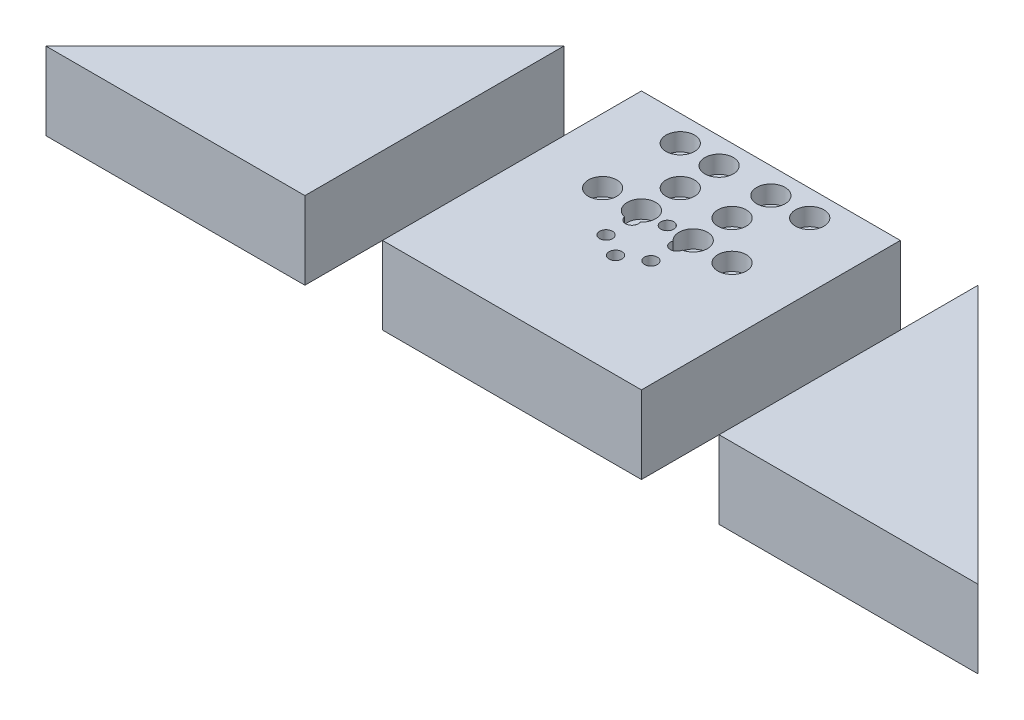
ISO-10303-21;
HEADER;
FILE_DESCRIPTION(('STEP AP214'),'2;1');
FILE_NAME('part.step','',(''),(''),'','','');
FILE_SCHEMA(('AUTOMOTIVE_DESIGN { 1 0 10303 214 1 1 1 1 }'));
ENDSEC;
DATA;
#1=APPLICATION_CONTEXT('core data for automotive mechanical design processes');
#2=APPLICATION_PROTOCOL_DEFINITION('international standard','automotive_design',2000,#1);
#3=PRODUCT_CONTEXT('',#1,'mechanical');
#4=PRODUCT('Part','Part','',(#3));
#5=PRODUCT_RELATED_PRODUCT_CATEGORY('part','',(#4));
#6=PRODUCT_DEFINITION_FORMATION('','',#4);
#7=PRODUCT_DEFINITION_CONTEXT('part definition',#1,'design');
#8=PRODUCT_DEFINITION('design','',#6,#7);
#9=PRODUCT_DEFINITION_SHAPE('','',#8);
#10=(LENGTH_UNIT() NAMED_UNIT(*) SI_UNIT(.MILLI.,.METRE.));
#11=(NAMED_UNIT(*) PLANE_ANGLE_UNIT() SI_UNIT($,.RADIAN.));
#12=(NAMED_UNIT(*) SI_UNIT($,.STERADIAN.) SOLID_ANGLE_UNIT());
#13=UNCERTAINTY_MEASURE_WITH_UNIT(LENGTH_MEASURE(1.E-05),#10,'distance_accuracy_value','');
#14=(GEOMETRIC_REPRESENTATION_CONTEXT(3) GLOBAL_UNCERTAINTY_ASSIGNED_CONTEXT((#13)) GLOBAL_UNIT_ASSIGNED_CONTEXT((#10,
#11,#12)) REPRESENTATION_CONTEXT('',''));
#15=CARTESIAN_POINT('',(0.,0.,0.));
#16=DIRECTION('',(0.,0.,1.));
#17=DIRECTION('',(1.,0.,0.));
#18=AXIS2_PLACEMENT_3D('',#15,#16,#17);
#19=CARTESIAN_POINT('',(-80.,30.,-50.));
#20=DIRECTION('',(-1.,0.,0.));
#21=DIRECTION('',(0.,0.,-1.));
#22=AXIS2_PLACEMENT_3D('',#19,#20,#21);
#23=PLANE('',#22);
#24=DIRECTION('',(0.,0.,1.));
#25=VECTOR('',#24,1.);
#26=CARTESIAN_POINT('',(-80.,0.,-50.));
#27=LINE('',#26,#25);
#28=CARTESIAN_POINT('',(-80.,0.,-50.));
#29=VERTEX_POINT('',#28);
#30=CARTESIAN_POINT('',(-80.,0.,50.));
#31=VERTEX_POINT('',#30);
#32=EDGE_CURVE('E98',#29,#31,#27,.T.);
#33=ORIENTED_EDGE('',*,*,#32,.F.);
#34=DIRECTION('',(0.,-1.,0.));
#35=VECTOR('',#34,1.);
#36=CARTESIAN_POINT('',(-80.,30.,-50.));
#37=LINE('',#36,#35);
#38=CARTESIAN_POINT('',(-80.,30.,-50.));
#39=VERTEX_POINT('',#38);
#40=EDGE_CURVE('E93',#39,#29,#37,.T.);
#41=ORIENTED_EDGE('',*,*,#40,.F.);
#42=DIRECTION('',(0.,0.,1.));
#43=VECTOR('',#42,1.);
#44=CARTESIAN_POINT('',(-80.,30.,-50.));
#45=LINE('',#44,#43);
#46=CARTESIAN_POINT('',(-80.,30.,50.));
#47=VERTEX_POINT('',#46);
#48=EDGE_CURVE('E85',#39,#47,#45,.T.);
#49=ORIENTED_EDGE('',*,*,#48,.T.);
#50=DIRECTION('',(0.,-1.,0.));
#51=VECTOR('',#50,1.);
#52=CARTESIAN_POINT('',(-80.,30.,50.));
#53=LINE('',#52,#51);
#54=EDGE_CURVE('E12',#47,#31,#53,.T.);
#55=ORIENTED_EDGE('',*,*,#54,.T.);
#56=EDGE_LOOP('',(#33,#41,#49,#55));
#57=FACE_BOUND('',#56,.T.);
#58=ADVANCED_FACE('F46',(#57),#23,.F.);
#59=CARTESIAN_POINT('',(-80.,30.,50.));
#60=DIRECTION('',(0.,0.,-1.));
#61=DIRECTION('',(1.,0.,0.));
#62=AXIS2_PLACEMENT_3D('',#59,#60,#61);
#63=PLANE('',#62);
#64=DIRECTION('',(-1.,0.,0.));
#65=VECTOR('',#64,1.);
#66=CARTESIAN_POINT('',(-80.,0.,50.));
#67=LINE('',#66,#65);
#68=CARTESIAN_POINT('',(-180.,0.,50.));
#69=VERTEX_POINT('',#68);
#70=EDGE_CURVE('E90',#31,#69,#67,.T.);
#71=ORIENTED_EDGE('',*,*,#70,.F.);
#72=ORIENTED_EDGE('',*,*,#54,.F.);
#73=DIRECTION('',(-1.,0.,0.));
#74=VECTOR('',#73,1.);
#75=CARTESIAN_POINT('',(-80.,30.,50.));
#76=LINE('',#75,#74);
#77=CARTESIAN_POINT('',(-180.,30.,50.));
#78=VERTEX_POINT('',#77);
#79=EDGE_CURVE('E81',#47,#78,#76,.T.);
#80=ORIENTED_EDGE('',*,*,#79,.T.);
#81=DIRECTION('',(0.,-1.,0.));
#82=VECTOR('',#81,1.);
#83=CARTESIAN_POINT('',(-180.,30.,50.));
#84=LINE('',#83,#82);
#85=EDGE_CURVE('E54',#78,#69,#84,.T.);
#86=ORIENTED_EDGE('',*,*,#85,.T.);
#87=EDGE_LOOP('',(#71,#72,#80,#86));
#88=FACE_BOUND('',#87,.T.);
#89=ADVANCED_FACE('F89',(#88),#63,.F.);
#90=CARTESIAN_POINT('',(-180.,30.,50.));
#91=DIRECTION('',(0.707106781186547,0.,0.707106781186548));
#92=DIRECTION('',(-0.707106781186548,0.,0.707106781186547));
#93=AXIS2_PLACEMENT_3D('',#90,#91,#92);
#94=PLANE('',#93);
#95=DIRECTION('',(0.707106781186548,0.,-0.707106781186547));
#96=VECTOR('',#95,1.);
#97=CARTESIAN_POINT('',(-180.,0.,50.));
#98=LINE('',#97,#96);
#99=EDGE_CURVE('E73',#69,#29,#98,.T.);
#100=ORIENTED_EDGE('',*,*,#99,.F.);
#101=ORIENTED_EDGE('',*,*,#85,.F.);
#102=DIRECTION('',(0.707106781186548,0.,-0.707106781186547));
#103=VECTOR('',#102,1.);
#104=CARTESIAN_POINT('',(-180.,30.,50.));
#105=LINE('',#104,#103);
#106=EDGE_CURVE('E62',#78,#39,#105,.T.);
#107=ORIENTED_EDGE('',*,*,#106,.T.);
#108=ORIENTED_EDGE('',*,*,#40,.T.);
#109=EDGE_LOOP('',(#100,#101,#107,#108));
#110=FACE_BOUND('',#109,.T.);
#111=ADVANCED_FACE('F107',(#110),#94,.F.);
#112=CARTESIAN_POINT('',(0.,30.,0.));
#113=DIRECTION('',(0.,1.,0.));
#114=DIRECTION('',(0.,0.,1.));
#115=AXIS2_PLACEMENT_3D('',#112,#113,#114);
#116=PLANE('',#115);
#117=ORIENTED_EDGE('',*,*,#48,.F.);
#118=ORIENTED_EDGE('',*,*,#106,.F.);
#119=ORIENTED_EDGE('',*,*,#79,.F.);
#120=EDGE_LOOP('',(#117,#118,#119));
#121=FACE_BOUND('',#120,.T.);
#122=ADVANCED_FACE('F83',(#121),#116,.T.);
#123=CARTESIAN_POINT('',(0.,0.,0.));
#124=DIRECTION('',(0.,1.,0.));
#125=DIRECTION('',(0.,0.,1.));
#126=AXIS2_PLACEMENT_3D('',#123,#124,#125);
#127=PLANE('',#126);
#128=ORIENTED_EDGE('',*,*,#32,.T.);
#129=ORIENTED_EDGE('',*,*,#70,.T.);
#130=ORIENTED_EDGE('',*,*,#99,.T.);
#131=EDGE_LOOP('',(#128,#129,#130));
#132=FACE_BOUND('',#131,.T.);
#133=ADVANCED_FACE('F101',(#132),#127,.F.);
#134=CLOSED_SHELL('',(#58,#89,#111,#122,#133));
#135=MANIFOLD_SOLID_BREP('B2',#134);
#136=CARTESIAN_POINT('',(80.,30.,-50.));
#137=DIRECTION('',(1.,0.,0.));
#138=DIRECTION('',(0.,0.,-1.));
#139=AXIS2_PLACEMENT_3D('',#136,#137,#138);
#140=PLANE('',#139);
#141=DIRECTION('',(0.,0.,1.));
#142=VECTOR('',#141,1.);
#143=CARTESIAN_POINT('',(80.,0.,-50.));
#144=LINE('',#143,#142);
#145=CARTESIAN_POINT('',(80.,0.,-50.));
#146=VERTEX_POINT('',#145);
#147=CARTESIAN_POINT('',(80.,0.,50.));
#148=VERTEX_POINT('',#147);
#149=EDGE_CURVE('E200',#146,#148,#144,.T.);
#150=ORIENTED_EDGE('',*,*,#149,.T.);
#151=DIRECTION('',(0.,-1.,0.));
#152=VECTOR('',#151,1.);
#153=CARTESIAN_POINT('',(80.,30.,50.));
#154=LINE('',#153,#152);
#155=CARTESIAN_POINT('',(80.,30.,50.));
#156=VERTEX_POINT('',#155);
#157=EDGE_CURVE('E44',#156,#148,#154,.T.);
#158=ORIENTED_EDGE('',*,*,#157,.F.);
#159=DIRECTION('',(0.,0.,1.));
#160=VECTOR('',#159,1.);
#161=CARTESIAN_POINT('',(80.,30.,-50.));
#162=LINE('',#161,#160);
#163=CARTESIAN_POINT('',(80.,30.,-50.));
#164=VERTEX_POINT('',#163);
#165=EDGE_CURVE('E193',#164,#156,#162,.T.);
#166=ORIENTED_EDGE('',*,*,#165,.F.);
#167=DIRECTION('',(0.,-1.,0.));
#168=VECTOR('',#167,1.);
#169=CARTESIAN_POINT('',(80.,30.,-50.));
#170=LINE('',#169,#168);
#171=EDGE_CURVE('E201',#164,#146,#170,.T.);
#172=ORIENTED_EDGE('',*,*,#171,.T.);
#173=EDGE_LOOP('',(#150,#158,#166,#172));
#174=FACE_BOUND('',#173,.T.);
#175=ADVANCED_FACE('F153',(#174),#140,.F.);
#176=CARTESIAN_POINT('',(80.,30.,50.));
#177=DIRECTION('',(0.,0.,-1.));
#178=DIRECTION('',(-1.,0.,0.));
#179=AXIS2_PLACEMENT_3D('',#176,#177,#178);
#180=PLANE('',#179);
#181=DIRECTION('',(1.,0.,0.));
#182=VECTOR('',#181,1.);
#183=CARTESIAN_POINT('',(80.,0.,50.));
#184=LINE('',#183,#182);
#185=CARTESIAN_POINT('',(180.,0.,50.));
#186=VERTEX_POINT('',#185);
#187=EDGE_CURVE('E181',#148,#186,#184,.T.);
#188=ORIENTED_EDGE('',*,*,#187,.T.);
#189=DIRECTION('',(0.,-1.,0.));
#190=VECTOR('',#189,1.);
#191=CARTESIAN_POINT('',(180.,30.,50.));
#192=LINE('',#191,#190);
#193=CARTESIAN_POINT('',(180.,30.,50.));
#194=VERTEX_POINT('',#193);
#195=EDGE_CURVE('E161',#194,#186,#192,.T.);
#196=ORIENTED_EDGE('',*,*,#195,.F.);
#197=DIRECTION('',(1.,0.,0.));
#198=VECTOR('',#197,1.);
#199=CARTESIAN_POINT('',(80.,30.,50.));
#200=LINE('',#199,#198);
#201=EDGE_CURVE('E189',#156,#194,#200,.T.);
#202=ORIENTED_EDGE('',*,*,#201,.F.);
#203=ORIENTED_EDGE('',*,*,#157,.T.);
#204=EDGE_LOOP('',(#188,#196,#202,#203));
#205=FACE_BOUND('',#204,.T.);
#206=ADVANCED_FACE('F190',(#205),#180,.F.);
#207=CARTESIAN_POINT('',(180.,30.,50.));
#208=DIRECTION('',(-0.707106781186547,0.,0.707106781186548));
#209=DIRECTION('',(0.707106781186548,0.,0.707106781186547));
#210=AXIS2_PLACEMENT_3D('',#207,#208,#209);
#211=PLANE('',#210);
#212=DIRECTION('',(-0.707106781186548,0.,-0.707106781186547));
#213=VECTOR('',#212,1.);
#214=CARTESIAN_POINT('',(180.,0.,50.));
#215=LINE('',#214,#213);
#216=EDGE_CURVE('E186',#186,#146,#215,.T.);
#217=ORIENTED_EDGE('',*,*,#216,.T.);
#218=ORIENTED_EDGE('',*,*,#171,.F.);
#219=DIRECTION('',(-0.707106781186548,0.,-0.707106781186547));
#220=VECTOR('',#219,1.);
#221=CARTESIAN_POINT('',(180.,30.,50.));
#222=LINE('',#221,#220);
#223=EDGE_CURVE('E169',#194,#164,#222,.T.);
#224=ORIENTED_EDGE('',*,*,#223,.F.);
#225=ORIENTED_EDGE('',*,*,#195,.T.);
#226=EDGE_LOOP('',(#217,#218,#224,#225));
#227=FACE_BOUND('',#226,.T.);
#228=ADVANCED_FACE('F208',(#227),#211,.F.);
#229=CARTESIAN_POINT('',(0.,30.,0.));
#230=DIRECTION('',(0.,1.,0.));
#231=DIRECTION('',(0.,0.,1.));
#232=AXIS2_PLACEMENT_3D('',#229,#230,#231);
#233=PLANE('',#232);
#234=ORIENTED_EDGE('',*,*,#165,.T.);
#235=ORIENTED_EDGE('',*,*,#201,.T.);
#236=ORIENTED_EDGE('',*,*,#223,.T.);
#237=EDGE_LOOP('',(#234,#235,#236));
#238=FACE_BOUND('',#237,.T.);
#239=ADVANCED_FACE('F196',(#238),#233,.T.);
#240=CARTESIAN_POINT('',(0.,0.,0.));
#241=DIRECTION('',(0.,1.,0.));
#242=DIRECTION('',(0.,0.,1.));
#243=AXIS2_PLACEMENT_3D('',#240,#241,#242);
#244=PLANE('',#243);
#245=ORIENTED_EDGE('',*,*,#149,.F.);
#246=ORIENTED_EDGE('',*,*,#216,.F.);
#247=ORIENTED_EDGE('',*,*,#187,.F.);
#248=EDGE_LOOP('',(#245,#246,#247));
#249=FACE_BOUND('',#248,.T.);
#250=ADVANCED_FACE('F209',(#249),#244,.F.);
#251=CLOSED_SHELL('',(#175,#206,#228,#239,#250));
#252=MANIFOLD_SOLID_BREP('B6',#251);
#253=CARTESIAN_POINT('',(0.,0.,0.));
#254=DIRECTION('',(0.,-1.,0.));
#255=DIRECTION('',(0.,0.,-1.));
#256=AXIS2_PLACEMENT_3D('',#253,#254,#255);
#257=PLANE('',#256);
#258=CARTESIAN_POINT('',(8.66025403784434,0.,-5.0000000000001));
#259=DIRECTION('',(0.,1.,0.));
#260=DIRECTION('',(0.,0.,1.));
#261=AXIS2_PLACEMENT_3D('',#258,#259,#260);
#262=CIRCLE('',#261,2.5);
#263=CARTESIAN_POINT('',(7.96572766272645,0.,-7.40158970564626));
#264=VERTEX_POINT('',#263);
#265=CARTESIAN_POINT('',(10.4625263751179,0.,-6.73257450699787));
#266=VERTEX_POINT('',#265);
#267=EDGE_CURVE('E347',#264,#266,#262,.T.);
#268=ORIENTED_EDGE('',*,*,#267,.T.);
#269=CARTESIAN_POINT('',(10.,0.,-10.));
#270=DIRECTION('',(0.,1.,0.));
#271=DIRECTION('',(0.,0.,1.));
#272=AXIS2_PLACEMENT_3D('',#269,#270,#271);
#273=CIRCLE('',#272,3.29999999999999);
#274=EDGE_CURVE('E266',#266,#264,#273,.T.);
#275=ORIENTED_EDGE('',*,*,#274,.T.);
#276=EDGE_LOOP('',(#268,#275));
#277=FACE_BOUND('',#276,.T.);
#278=CARTESIAN_POINT('',(0.,0.,10.));
#279=DIRECTION('',(0.,1.,0.));
#280=DIRECTION('',(0.,0.,1.));
#281=AXIS2_PLACEMENT_3D('',#278,#279,#280);
#282=CIRCLE('',#281,2.49999999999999);
#283=CARTESIAN_POINT('',(0.,0.,12.5));
#284=VERTEX_POINT('',#283);
#285=EDGE_CURVE('E369',#284,#284,#282,.T.);
#286=ORIENTED_EDGE('',*,*,#285,.T.);
#287=EDGE_LOOP('',(#286));
#288=FACE_BOUND('',#287,.T.);
#289=CARTESIAN_POINT('',(-8.66025403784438,0.,5.00000000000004));
#290=DIRECTION('',(0.,1.,0.));
#291=DIRECTION('',(0.,0.,1.));
#292=AXIS2_PLACEMENT_3D('',#289,#290,#291);
#293=CIRCLE('',#292,2.5);
#294=CARTESIAN_POINT('',(-8.66025403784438,0.,7.50000000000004));
#295=VERTEX_POINT('',#294);
#296=EDGE_CURVE('E375',#295,#295,#293,.T.);
#297=ORIENTED_EDGE('',*,*,#296,.T.);
#298=EDGE_LOOP('',(#297));
#299=FACE_BOUND('',#298,.T.);
#300=CARTESIAN_POINT('',(-10.,0.,-40.));
#301=DIRECTION('',(0.,1.,0.));
#302=DIRECTION('',(0.,0.,1.));
#303=AXIS2_PLACEMENT_3D('',#300,#301,#302);
#304=CIRCLE('',#303,3.29999999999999);
#305=CARTESIAN_POINT('',(-10.,0.,-36.7));
#306=VERTEX_POINT('',#305);
#307=EDGE_CURVE('E400',#306,#306,#304,.T.);
#308=ORIENTED_EDGE('',*,*,#307,.T.);
#309=EDGE_LOOP('',(#308));
#310=FACE_BOUND('',#309,.T.);
#311=CARTESIAN_POINT('',(-10.,0.,-25.));
#312=DIRECTION('',(0.,1.,0.));
#313=DIRECTION('',(0.,0.,1.));
#314=AXIS2_PLACEMENT_3D('',#311,#312,#313);
#315=CIRCLE('',#314,3.29999999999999);
#316=CARTESIAN_POINT('',(-10.,0.,-21.7));
#317=VERTEX_POINT('',#316);
#318=EDGE_CURVE('E412',#317,#317,#315,.T.);
#319=ORIENTED_EDGE('',*,*,#318,.T.);
#320=EDGE_LOOP('',(#319));
#321=FACE_BOUND('',#320,.T.);
#322=CARTESIAN_POINT('',(-25.,0.,-40.));
#323=DIRECTION('',(0.,1.,0.));
#324=DIRECTION('',(0.,0.,1.));
#325=AXIS2_PLACEMENT_3D('',#322,#323,#324);
#326=CIRCLE('',#325,3.29999999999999);
#327=CARTESIAN_POINT('',(-25.,0.,-36.7));
#328=VERTEX_POINT('',#327);
#329=EDGE_CURVE('E436',#328,#328,#326,.T.);
#330=ORIENTED_EDGE('',*,*,#329,.T.);
#331=EDGE_LOOP('',(#330));
#332=FACE_BOUND('',#331,.T.);
#333=CARTESIAN_POINT('',(0.,0.,-10.));
#334=DIRECTION('',(0.,1.,0.));
#335=DIRECTION('',(0.,0.,1.));
#336=AXIS2_PLACEMENT_3D('',#333,#334,#335);
#337=CIRCLE('',#336,2.49999999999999);
#338=CARTESIAN_POINT('',(0.,0.,-7.50000000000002));
#339=VERTEX_POINT('',#338);
#340=EDGE_CURVE('E442',#339,#339,#337,.T.);
#341=ORIENTED_EDGE('',*,*,#340,.T.);
#342=EDGE_LOOP('',(#341));
#343=FACE_BOUND('',#342,.T.);
#344=CARTESIAN_POINT('',(-25.,0.,-10.));
#345=DIRECTION('',(0.,1.,0.));
#346=DIRECTION('',(0.,0.,1.));
#347=AXIS2_PLACEMENT_3D('',#344,#345,#346);
#348=CIRCLE('',#347,3.29999999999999);
#349=CARTESIAN_POINT('',(-25.,0.,-6.70000000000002));
#350=VERTEX_POINT('',#349);
#351=EDGE_CURVE('E454',#350,#350,#348,.T.);
#352=ORIENTED_EDGE('',*,*,#351,.T.);
#353=EDGE_LOOP('',(#352));
#354=FACE_BOUND('',#353,.T.);
#355=DIRECTION('',(0.,0.,-1.));
#356=VECTOR('',#355,1.);
#357=CARTESIAN_POINT('',(50.,0.,50.));
#358=LINE('',#357,#356);
#359=CARTESIAN_POINT('',(50.,0.,50.));
#360=VERTEX_POINT('',#359);
#361=CARTESIAN_POINT('',(50.,0.,-50.));
#362=VERTEX_POINT('',#361);
#363=EDGE_CURVE('E457',#360,#362,#358,.T.);
#364=ORIENTED_EDGE('',*,*,#363,.F.);
#365=DIRECTION('',(1.,0.,0.));
#366=VECTOR('',#365,1.);
#367=CARTESIAN_POINT('',(-50.,0.,50.));
#368=LINE('',#367,#366);
#369=CARTESIAN_POINT('',(-50.,0.,50.));
#370=VERTEX_POINT('',#369);
#371=EDGE_CURVE('E462',#370,#360,#368,.T.);
#372=ORIENTED_EDGE('',*,*,#371,.F.);
#373=DIRECTION('',(0.,0.,1.));
#374=VECTOR('',#373,1.);
#375=CARTESIAN_POINT('',(-50.,0.,50.));
#376=LINE('',#375,#374);
#377=CARTESIAN_POINT('',(-50.,0.,-50.));
#378=VERTEX_POINT('',#377);
#379=EDGE_CURVE('E473',#378,#370,#376,.T.);
#380=ORIENTED_EDGE('',*,*,#379,.F.);
#381=DIRECTION('',(-1.,0.,0.));
#382=VECTOR('',#381,1.);
#383=CARTESIAN_POINT('',(-50.,0.,-50.));
#384=LINE('',#383,#382);
#385=EDGE_CURVE('E471',#362,#378,#384,.T.);
#386=ORIENTED_EDGE('',*,*,#385,.F.);
#387=EDGE_LOOP('',(#364,#372,#380,#386));
#388=FACE_BOUND('',#387,.T.);
#389=CARTESIAN_POINT('',(-10.,0.,-10.));
#390=DIRECTION('',(0.,1.,0.));
#391=DIRECTION('',(0.,0.,1.));
#392=AXIS2_PLACEMENT_3D('',#389,#390,#391);
#393=CIRCLE('',#392,3.29999999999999);
#394=CARTESIAN_POINT('',(-7.96572766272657,0.,-7.40158970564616));
#395=VERTEX_POINT('',#394);
#396=CARTESIAN_POINT('',(-10.4625263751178,0.,-6.73257450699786));
#397=VERTEX_POINT('',#396);
#398=EDGE_CURVE('E424',#395,#397,#393,.T.);
#399=ORIENTED_EDGE('',*,*,#398,.T.);
#400=CARTESIAN_POINT('',(-8.66025403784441,0.,-4.99999999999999));
#401=DIRECTION('',(0.,1.,0.));
#402=DIRECTION('',(0.,0.,1.));
#403=AXIS2_PLACEMENT_3D('',#400,#401,#402);
#404=CIRCLE('',#403,2.5);
#405=EDGE_CURVE('E380',#397,#395,#404,.T.);
#406=ORIENTED_EDGE('',*,*,#405,.T.);
#407=EDGE_LOOP('',(#399,#406));
#408=FACE_BOUND('',#407,.T.);
#409=CARTESIAN_POINT('',(8.66025403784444,0.,4.99999999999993));
#410=DIRECTION('',(0.,1.,0.));
#411=DIRECTION('',(0.,0.,1.));
#412=AXIS2_PLACEMENT_3D('',#409,#410,#411);
#413=CIRCLE('',#412,2.5);
#414=CARTESIAN_POINT('',(8.66025403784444,0.,7.49999999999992));
#415=VERTEX_POINT('',#414);
#416=EDGE_CURVE('E357',#415,#415,#413,.T.);
#417=ORIENTED_EDGE('',*,*,#416,.T.);
#418=EDGE_LOOP('',(#417));
#419=FACE_BOUND('',#418,.T.);
#420=CARTESIAN_POINT('',(25.,0.,-10.));
#421=DIRECTION('',(0.,1.,0.));
#422=DIRECTION('',(0.,0.,1.));
#423=AXIS2_PLACEMENT_3D('',#420,#421,#422);
#424=CIRCLE('',#423,3.29999999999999);
#425=CARTESIAN_POINT('',(25.,0.,-6.70000000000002));
#426=VERTEX_POINT('',#425);
#427=EDGE_CURVE('E360',#426,#426,#424,.T.);
#428=ORIENTED_EDGE('',*,*,#427,.T.);
#429=EDGE_LOOP('',(#428));
#430=FACE_BOUND('',#429,.T.);
#431=CARTESIAN_POINT('',(25.,0.,-40.));
#432=DIRECTION('',(0.,1.,0.));
#433=DIRECTION('',(0.,0.,1.));
#434=AXIS2_PLACEMENT_3D('',#431,#432,#433);
#435=CIRCLE('',#434,3.29999999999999);
#436=CARTESIAN_POINT('',(25.,0.,-36.7));
#437=VERTEX_POINT('',#436);
#438=EDGE_CURVE('E521',#437,#437,#435,.T.);
#439=ORIENTED_EDGE('',*,*,#438,.T.);
#440=EDGE_LOOP('',(#439));
#441=FACE_BOUND('',#440,.T.);
#442=CARTESIAN_POINT('',(10.,0.,-25.));
#443=DIRECTION('',(0.,1.,0.));
#444=DIRECTION('',(0.,0.,1.));
#445=AXIS2_PLACEMENT_3D('',#442,#443,#444);
#446=CIRCLE('',#445,3.29999999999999);
#447=CARTESIAN_POINT('',(10.,0.,-21.7));
#448=VERTEX_POINT('',#447);
#449=EDGE_CURVE('E509',#448,#448,#446,.T.);
#450=ORIENTED_EDGE('',*,*,#449,.T.);
#451=EDGE_LOOP('',(#450));
#452=FACE_BOUND('',#451,.T.);
#453=CARTESIAN_POINT('',(10.,0.,-40.));
#454=DIRECTION('',(0.,1.,0.));
#455=DIRECTION('',(0.,0.,1.));
#456=AXIS2_PLACEMENT_3D('',#453,#454,#455);
#457=CIRCLE('',#456,3.29999999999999);
#458=CARTESIAN_POINT('',(10.,0.,-36.7));
#459=VERTEX_POINT('',#458);
#460=EDGE_CURVE('E570',#459,#459,#457,.T.);
#461=ORIENTED_EDGE('',*,*,#460,.T.);
#462=EDGE_LOOP('',(#461));
#463=FACE_BOUND('',#462,.T.);
#464=ADVANCED_FACE('F251',(#277,#288,#299,#310,#321,#332,#343,#354,#388,#408,#419,#430,#441,
#452,#463),#257,.T.);
#465=CARTESIAN_POINT('',(0.,30.,0.));
#466=DIRECTION('',(0.,-1.,0.));
#467=DIRECTION('',(0.,0.,-1.));
#468=AXIS2_PLACEMENT_3D('',#465,#466,#467);
#469=PLANE('',#468);
#470=CARTESIAN_POINT('',(10.,30.,-40.));
#471=DIRECTION('',(0.,1.,0.));
#472=DIRECTION('',(0.,0.,1.));
#473=AXIS2_PLACEMENT_3D('',#470,#471,#472);
#474=CIRCLE('',#473,5.49999999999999);
#475=CARTESIAN_POINT('',(10.,30.,-34.5));
#476=VERTEX_POINT('',#475);
#477=EDGE_CURVE('E955',#476,#476,#474,.T.);
#478=ORIENTED_EDGE('',*,*,#477,.F.);
#479=EDGE_LOOP('',(#478));
#480=FACE_BOUND('',#479,.T.);
#481=CARTESIAN_POINT('',(0.,30.,10.));
#482=DIRECTION('',(0.,1.,0.));
#483=DIRECTION('',(0.,0.,1.));
#484=AXIS2_PLACEMENT_3D('',#481,#482,#483);
#485=CIRCLE('',#484,2.49999999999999);
#486=CARTESIAN_POINT('',(0.,30.,12.5));
#487=VERTEX_POINT('',#486);
#488=EDGE_CURVE('E366',#487,#487,#485,.T.);
#489=ORIENTED_EDGE('',*,*,#488,.F.);
#490=EDGE_LOOP('',(#489));
#491=FACE_BOUND('',#490,.T.);
#492=CARTESIAN_POINT('',(-8.66025403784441,30.,-4.99999999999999));
#493=DIRECTION('',(0.,1.,0.));
#494=DIRECTION('',(0.,0.,1.));
#495=AXIS2_PLACEMENT_3D('',#492,#493,#494);
#496=CIRCLE('',#495,2.49999999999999);
#497=CARTESIAN_POINT('',(-11.1308203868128,30.,-4.61750566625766));
#498=VERTEX_POINT('',#497);
#499=CARTESIAN_POINT('',(-6.32943365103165,30.,-5.90403336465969));
#500=VERTEX_POINT('',#499);
#501=EDGE_CURVE('E378',#498,#500,#496,.T.);
#502=ORIENTED_EDGE('',*,*,#501,.F.);
#503=CARTESIAN_POINT('',(-10.,30.,-10.));
#504=DIRECTION('',(0.,1.,0.));
#505=DIRECTION('',(0.,0.,1.));
#506=AXIS2_PLACEMENT_3D('',#503,#504,#505);
#507=CIRCLE('',#506,5.49999999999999);
#508=EDGE_CURVE('E415',#500,#498,#507,.T.);
#509=ORIENTED_EDGE('',*,*,#508,.F.);
#510=EDGE_LOOP('',(#502,#509));
#511=FACE_BOUND('',#510,.T.);
#512=CARTESIAN_POINT('',(-10.,30.,-25.));
#513=DIRECTION('',(0.,1.,0.));
#514=DIRECTION('',(0.,0.,1.));
#515=AXIS2_PLACEMENT_3D('',#512,#513,#514);
#516=CIRCLE('',#515,5.49999999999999);
#517=CARTESIAN_POINT('',(-10.,30.,-19.5));
#518=VERTEX_POINT('',#517);
#519=EDGE_CURVE('E403',#518,#518,#516,.T.);
#520=ORIENTED_EDGE('',*,*,#519,.F.);
#521=EDGE_LOOP('',(#520));
#522=FACE_BOUND('',#521,.T.);
#523=CARTESIAN_POINT('',(-25.,30.,-40.));
#524=DIRECTION('',(0.,1.,0.));
#525=DIRECTION('',(0.,0.,1.));
#526=AXIS2_PLACEMENT_3D('',#523,#524,#525);
#527=CIRCLE('',#526,5.49999999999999);
#528=CARTESIAN_POINT('',(-25.,30.,-34.5));
#529=VERTEX_POINT('',#528);
#530=EDGE_CURVE('E427',#529,#529,#527,.T.);
#531=ORIENTED_EDGE('',*,*,#530,.F.);
#532=EDGE_LOOP('',(#531));
#533=FACE_BOUND('',#532,.T.);
#534=CARTESIAN_POINT('',(0.,30.,-10.));
#535=DIRECTION('',(0.,1.,0.));
#536=DIRECTION('',(0.,0.,1.));
#537=AXIS2_PLACEMENT_3D('',#534,#535,#536);
#538=CIRCLE('',#537,2.49999999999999);
#539=CARTESIAN_POINT('',(0.,30.,-7.50000000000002));
#540=VERTEX_POINT('',#539);
#541=EDGE_CURVE('E439',#540,#540,#538,.T.);
#542=ORIENTED_EDGE('',*,*,#541,.F.);
#543=EDGE_LOOP('',(#542));
#544=FACE_BOUND('',#543,.T.);
#545=CARTESIAN_POINT('',(-25.,30.,-10.));
#546=DIRECTION('',(0.,1.,0.));
#547=DIRECTION('',(0.,0.,1.));
#548=AXIS2_PLACEMENT_3D('',#545,#546,#547);
#549=CIRCLE('',#548,5.49999999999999);
#550=CARTESIAN_POINT('',(-25.,30.,-4.50000000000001));
#551=VERTEX_POINT('',#550);
#552=EDGE_CURVE('E445',#551,#551,#549,.T.);
#553=ORIENTED_EDGE('',*,*,#552,.F.);
#554=EDGE_LOOP('',(#553));
#555=FACE_BOUND('',#554,.T.);
#556=DIRECTION('',(0.,0.,-1.));
#557=VECTOR('',#556,1.);
#558=CARTESIAN_POINT('',(50.,30.,50.));
#559=LINE('',#558,#557);
#560=CARTESIAN_POINT('',(50.,30.,50.));
#561=VERTEX_POINT('',#560);
#562=CARTESIAN_POINT('',(50.,30.,-50.));
#563=VERTEX_POINT('',#562);
#564=EDGE_CURVE('E458',#561,#563,#559,.T.);
#565=ORIENTED_EDGE('',*,*,#564,.T.);
#566=DIRECTION('',(-1.,0.,0.));
#567=VECTOR('',#566,1.);
#568=CARTESIAN_POINT('',(-50.,30.,-50.));
#569=LINE('',#568,#567);
#570=CARTESIAN_POINT('',(-50.,30.,-50.));
#571=VERTEX_POINT('',#570);
#572=EDGE_CURVE('E461',#563,#571,#569,.T.);
#573=ORIENTED_EDGE('',*,*,#572,.T.);
#574=DIRECTION('',(0.,0.,1.));
#575=VECTOR('',#574,1.);
#576=CARTESIAN_POINT('',(-50.,30.,50.));
#577=LINE('',#576,#575);
#578=CARTESIAN_POINT('',(-50.,30.,50.));
#579=VERTEX_POINT('',#578);
#580=EDGE_CURVE('E464',#571,#579,#577,.T.);
#581=ORIENTED_EDGE('',*,*,#580,.T.);
#582=DIRECTION('',(1.,0.,0.));
#583=VECTOR('',#582,1.);
#584=CARTESIAN_POINT('',(-50.,30.,50.));
#585=LINE('',#584,#583);
#586=EDGE_CURVE('E466',#579,#561,#585,.T.);
#587=ORIENTED_EDGE('',*,*,#586,.T.);
#588=EDGE_LOOP('',(#565,#573,#581,#587));
#589=FACE_BOUND('',#588,.T.);
#590=CARTESIAN_POINT('',(-10.,30.,-40.));
#591=DIRECTION('',(0.,1.,0.));
#592=DIRECTION('',(0.,0.,1.));
#593=AXIS2_PLACEMENT_3D('',#590,#591,#592);
#594=CIRCLE('',#593,5.49999999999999);
#595=CARTESIAN_POINT('',(-10.,30.,-34.5));
#596=VERTEX_POINT('',#595);
#597=EDGE_CURVE('E391',#596,#596,#594,.T.);
#598=ORIENTED_EDGE('',*,*,#597,.F.);
#599=EDGE_LOOP('',(#598));
#600=FACE_BOUND('',#599,.T.);
#601=CARTESIAN_POINT('',(-8.66025403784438,30.,5.00000000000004));
#602=DIRECTION('',(0.,1.,0.));
#603=DIRECTION('',(0.,0.,1.));
#604=AXIS2_PLACEMENT_3D('',#601,#602,#603);
#605=CIRCLE('',#604,2.49999999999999);
#606=CARTESIAN_POINT('',(-8.66025403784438,30.,7.50000000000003));
#607=VERTEX_POINT('',#606);
#608=EDGE_CURVE('E372',#607,#607,#605,.T.);
#609=ORIENTED_EDGE('',*,*,#608,.F.);
#610=EDGE_LOOP('',(#609));
#611=FACE_BOUND('',#610,.T.);
#612=CARTESIAN_POINT('',(8.66025403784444,30.,4.99999999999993));
#613=DIRECTION('',(0.,1.,0.));
#614=DIRECTION('',(0.,0.,1.));
#615=AXIS2_PLACEMENT_3D('',#612,#613,#614);
#616=CIRCLE('',#615,2.49999999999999);
#617=CARTESIAN_POINT('',(8.66025403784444,30.,7.49999999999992));
#618=VERTEX_POINT('',#617);
#619=EDGE_CURVE('E353',#618,#618,#616,.T.);
#620=ORIENTED_EDGE('',*,*,#619,.F.);
#621=EDGE_LOOP('',(#620));
#622=FACE_BOUND('',#621,.T.);
#623=CARTESIAN_POINT('',(25.,30.,-10.));
#624=DIRECTION('',(0.,1.,0.));
#625=DIRECTION('',(0.,0.,1.));
#626=AXIS2_PLACEMENT_3D('',#623,#624,#625);
#627=CIRCLE('',#626,5.49999999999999);
#628=CARTESIAN_POINT('',(25.,30.,-4.50000000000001));
#629=VERTEX_POINT('',#628);
#630=EDGE_CURVE('E524',#629,#629,#627,.T.);
#631=ORIENTED_EDGE('',*,*,#630,.F.);
#632=EDGE_LOOP('',(#631));
#633=FACE_BOUND('',#632,.T.);
#634=CARTESIAN_POINT('',(25.,30.,-40.));
#635=DIRECTION('',(0.,1.,0.));
#636=DIRECTION('',(0.,0.,1.));
#637=AXIS2_PLACEMENT_3D('',#634,#635,#636);
#638=CIRCLE('',#637,5.49999999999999);
#639=CARTESIAN_POINT('',(25.,30.,-34.5));
#640=VERTEX_POINT('',#639);
#641=EDGE_CURVE('E348',#640,#640,#638,.T.);
#642=ORIENTED_EDGE('',*,*,#641,.F.);
#643=EDGE_LOOP('',(#642));
#644=FACE_BOUND('',#643,.T.);
#645=CARTESIAN_POINT('',(10.,30.,-10.));
#646=DIRECTION('',(0.,1.,0.));
#647=DIRECTION('',(0.,0.,1.));
#648=AXIS2_PLACEMENT_3D('',#645,#646,#647);
#649=CIRCLE('',#648,5.49999999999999);
#650=CARTESIAN_POINT('',(11.1308203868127,30.,-4.61750566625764));
#651=VERTEX_POINT('',#650);
#652=CARTESIAN_POINT('',(6.32943365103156,30.,-5.90403336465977));
#653=VERTEX_POINT('',#652);
#654=EDGE_CURVE('E506',#651,#653,#649,.T.);
#655=ORIENTED_EDGE('',*,*,#654,.F.);
#656=CARTESIAN_POINT('',(8.66025403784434,30.,-5.0000000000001));
#657=DIRECTION('',(0.,1.,0.));
#658=DIRECTION('',(0.,0.,1.));
#659=AXIS2_PLACEMENT_3D('',#656,#657,#658);
#660=CIRCLE('',#659,2.49999999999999);
#661=EDGE_CURVE('E354',#653,#651,#660,.T.);
#662=ORIENTED_EDGE('',*,*,#661,.F.);
#663=EDGE_LOOP('',(#655,#662));
#664=FACE_BOUND('',#663,.T.);
#665=CARTESIAN_POINT('',(10.,30.,-25.));
#666=DIRECTION('',(0.,1.,0.));
#667=DIRECTION('',(0.,0.,1.));
#668=AXIS2_PLACEMENT_3D('',#665,#666,#667);
#669=CIRCLE('',#668,5.49999999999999);
#670=CARTESIAN_POINT('',(10.,30.,-19.5));
#671=VERTEX_POINT('',#670);
#672=EDGE_CURVE('E567',#671,#671,#669,.T.);
#673=ORIENTED_EDGE('',*,*,#672,.F.);
#674=EDGE_LOOP('',(#673));
#675=FACE_BOUND('',#674,.T.);
#676=ADVANCED_FACE('F556',(#480,#491,#511,#522,#533,#544,#555,#589,#600,#611,#622,#633,#644,
#664,#675),#469,.F.);
#677=CARTESIAN_POINT('',(50.,30.,50.));
#678=DIRECTION('',(-1.,0.,0.));
#679=DIRECTION('',(0.,0.,1.));
#680=AXIS2_PLACEMENT_3D('',#677,#678,#679);
#681=PLANE('',#680);
#682=ORIENTED_EDGE('',*,*,#363,.T.);
#683=DIRECTION('',(0.,-1.,0.));
#684=VECTOR('',#683,1.);
#685=CARTESIAN_POINT('',(50.,30.,-50.));
#686=LINE('',#685,#684);
#687=EDGE_CURVE('E484',#563,#362,#686,.T.);
#688=ORIENTED_EDGE('',*,*,#687,.F.);
#689=ORIENTED_EDGE('',*,*,#564,.F.);
#690=DIRECTION('',(0.,-1.,0.));
#691=VECTOR('',#690,1.);
#692=CARTESIAN_POINT('',(50.,30.,50.));
#693=LINE('',#692,#691);
#694=EDGE_CURVE('E468',#561,#360,#693,.T.);
#695=ORIENTED_EDGE('',*,*,#694,.T.);
#696=EDGE_LOOP('',(#682,#688,#689,#695));
#697=FACE_BOUND('',#696,.T.);
#698=ADVANCED_FACE('F253',(#697),#681,.F.);
#699=CARTESIAN_POINT('',(-50.,30.,-50.));
#700=DIRECTION('',(0.,0.,1.));
#701=DIRECTION('',(1.,0.,0.));
#702=AXIS2_PLACEMENT_3D('',#699,#700,#701);
#703=PLANE('',#702);
#704=ORIENTED_EDGE('',*,*,#385,.T.);
#705=DIRECTION('',(0.,-1.,0.));
#706=VECTOR('',#705,1.);
#707=CARTESIAN_POINT('',(-50.,30.,-50.));
#708=LINE('',#707,#706);
#709=EDGE_CURVE('E481',#571,#378,#708,.T.);
#710=ORIENTED_EDGE('',*,*,#709,.F.);
#711=ORIENTED_EDGE('',*,*,#572,.F.);
#712=ORIENTED_EDGE('',*,*,#687,.T.);
#713=EDGE_LOOP('',(#704,#710,#711,#712));
#714=FACE_BOUND('',#713,.T.);
#715=ADVANCED_FACE('F621',(#714),#703,.F.);
#716=CARTESIAN_POINT('',(-50.,30.,50.));
#717=DIRECTION('',(1.,0.,0.));
#718=DIRECTION('',(0.,0.,-1.));
#719=AXIS2_PLACEMENT_3D('',#716,#717,#718);
#720=PLANE('',#719);
#721=ORIENTED_EDGE('',*,*,#379,.T.);
#722=DIRECTION('',(0.,-1.,0.));
#723=VECTOR('',#722,1.);
#724=CARTESIAN_POINT('',(-50.,30.,50.));
#725=LINE('',#724,#723);
#726=EDGE_CURVE('E478',#579,#370,#725,.T.);
#727=ORIENTED_EDGE('',*,*,#726,.F.);
#728=ORIENTED_EDGE('',*,*,#580,.F.);
#729=ORIENTED_EDGE('',*,*,#709,.T.);
#730=EDGE_LOOP('',(#721,#727,#728,#729));
#731=FACE_BOUND('',#730,.T.);
#732=ADVANCED_FACE('F618',(#731),#720,.F.);
#733=CARTESIAN_POINT('',(-50.,30.,50.));
#734=DIRECTION('',(0.,0.,-1.));
#735=DIRECTION('',(-1.,0.,0.));
#736=AXIS2_PLACEMENT_3D('',#733,#734,#735);
#737=PLANE('',#736);
#738=ORIENTED_EDGE('',*,*,#371,.T.);
#739=ORIENTED_EDGE('',*,*,#694,.F.);
#740=ORIENTED_EDGE('',*,*,#586,.F.);
#741=ORIENTED_EDGE('',*,*,#726,.T.);
#742=EDGE_LOOP('',(#738,#739,#740,#741));
#743=FACE_BOUND('',#742,.T.);
#744=ADVANCED_FACE('F614',(#743),#737,.F.);
#745=CARTESIAN_POINT('',(-25.,30.,-10.));
#746=DIRECTION('',(0.,1.,0.));
#747=DIRECTION('',(0.,0.,1.));
#748=AXIS2_PLACEMENT_3D('',#745,#746,#747);
#749=CYLINDRICAL_SURFACE('',#748,3.29999999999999);
#750=ORIENTED_EDGE('',*,*,#351,.F.);
#751=EDGE_LOOP('',(#750));
#752=FACE_BOUND('',#751,.T.);
#753=CARTESIAN_POINT('',(-25.,23.2,-10.));
#754=DIRECTION('',(0.,1.,0.));
#755=DIRECTION('',(0.,0.,1.));
#756=AXIS2_PLACEMENT_3D('',#753,#754,#755);
#757=CIRCLE('',#756,3.3);
#758=CARTESIAN_POINT('',(-25.,23.2,-6.70000000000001));
#759=VERTEX_POINT('',#758);
#760=EDGE_CURVE('E451',#759,#759,#757,.T.);
#761=ORIENTED_EDGE('',*,*,#760,.T.);
#762=EDGE_LOOP('',(#761));
#763=FACE_BOUND('',#762,.T.);
#764=ADVANCED_FACE('F617',(#752,#763),#749,.F.);
#765=CARTESIAN_POINT('',(-21.7,23.2,-10.));
#766=DIRECTION('',(0.,-1.,0.));
#767=DIRECTION('',(0.,0.,-1.));
#768=AXIS2_PLACEMENT_3D('',#765,#766,#767);
#769=PLANE('',#768);
#770=ORIENTED_EDGE('',*,*,#760,.F.);
#771=EDGE_LOOP('',(#770));
#772=FACE_BOUND('',#771,.T.);
#773=CARTESIAN_POINT('',(-25.,23.2,-10.));
#774=DIRECTION('',(0.,1.,0.));
#775=DIRECTION('',(0.,0.,1.));
#776=AXIS2_PLACEMENT_3D('',#773,#774,#775);
#777=CIRCLE('',#776,5.5);
#778=CARTESIAN_POINT('',(-25.,23.2,-4.50000000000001));
#779=VERTEX_POINT('',#778);
#780=EDGE_CURVE('E448',#779,#779,#777,.T.);
#781=ORIENTED_EDGE('',*,*,#780,.T.);
#782=EDGE_LOOP('',(#781));
#783=FACE_BOUND('',#782,.T.);
#784=ADVANCED_FACE('F725',(#772,#783),#769,.F.);
#785=CARTESIAN_POINT('',(-25.,30.,-10.));
#786=DIRECTION('',(0.,1.,0.));
#787=DIRECTION('',(0.,0.,1.));
#788=AXIS2_PLACEMENT_3D('',#785,#786,#787);
#789=CYLINDRICAL_SURFACE('',#788,5.5);
#790=ORIENTED_EDGE('',*,*,#780,.F.);
#791=EDGE_LOOP('',(#790));
#792=FACE_BOUND('',#791,.T.);
#793=ORIENTED_EDGE('',*,*,#552,.T.);
#794=EDGE_LOOP('',(#793));
#795=FACE_BOUND('',#794,.T.);
#796=ADVANCED_FACE('F721',(#792,#795),#789,.F.);
#797=CARTESIAN_POINT('',(0.,30.,-10.));
#798=DIRECTION('',(0.,1.,0.));
#799=DIRECTION('',(0.,0.,1.));
#800=AXIS2_PLACEMENT_3D('',#797,#798,#799);
#801=CYLINDRICAL_SURFACE('',#800,2.49999999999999);
#802=ORIENTED_EDGE('',*,*,#340,.F.);
#803=EDGE_LOOP('',(#802));
#804=FACE_BOUND('',#803,.T.);
#805=ORIENTED_EDGE('',*,*,#541,.T.);
#806=EDGE_LOOP('',(#805));
#807=FACE_BOUND('',#806,.T.);
#808=ADVANCED_FACE('F717',(#804,#807),#801,.F.);
#809=CARTESIAN_POINT('',(-25.,30.,-40.));
#810=DIRECTION('',(0.,1.,0.));
#811=DIRECTION('',(0.,0.,1.));
#812=AXIS2_PLACEMENT_3D('',#809,#810,#811);
#813=CYLINDRICAL_SURFACE('',#812,3.29999999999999);
#814=ORIENTED_EDGE('',*,*,#329,.F.);
#815=EDGE_LOOP('',(#814));
#816=FACE_BOUND('',#815,.T.);
#817=CARTESIAN_POINT('',(-25.,23.2,-40.));
#818=DIRECTION('',(0.,1.,0.));
#819=DIRECTION('',(0.,0.,1.));
#820=AXIS2_PLACEMENT_3D('',#817,#818,#819);
#821=CIRCLE('',#820,3.3);
#822=CARTESIAN_POINT('',(-25.,23.2,-36.7));
#823=VERTEX_POINT('',#822);
#824=EDGE_CURVE('E433',#823,#823,#821,.T.);
#825=ORIENTED_EDGE('',*,*,#824,.T.);
#826=EDGE_LOOP('',(#825));
#827=FACE_BOUND('',#826,.T.);
#828=ADVANCED_FACE('F713',(#816,#827),#813,.F.);
#829=CARTESIAN_POINT('',(-21.7,23.2,-40.));
#830=DIRECTION('',(0.,-1.,0.));
#831=DIRECTION('',(0.,0.,-1.));
#832=AXIS2_PLACEMENT_3D('',#829,#830,#831);
#833=PLANE('',#832);
#834=ORIENTED_EDGE('',*,*,#824,.F.);
#835=EDGE_LOOP('',(#834));
#836=FACE_BOUND('',#835,.T.);
#837=CARTESIAN_POINT('',(-25.,23.2,-40.));
#838=DIRECTION('',(0.,1.,0.));
#839=DIRECTION('',(0.,0.,1.));
#840=AXIS2_PLACEMENT_3D('',#837,#838,#839);
#841=CIRCLE('',#840,5.5);
#842=CARTESIAN_POINT('',(-25.,23.2,-34.5));
#843=VERTEX_POINT('',#842);
#844=EDGE_CURVE('E430',#843,#843,#841,.T.);
#845=ORIENTED_EDGE('',*,*,#844,.T.);
#846=EDGE_LOOP('',(#845));
#847=FACE_BOUND('',#846,.T.);
#848=ADVANCED_FACE('F709',(#836,#847),#833,.F.);
#849=CARTESIAN_POINT('',(-25.,30.,-40.));
#850=DIRECTION('',(0.,1.,0.));
#851=DIRECTION('',(0.,0.,1.));
#852=AXIS2_PLACEMENT_3D('',#849,#850,#851);
#853=CYLINDRICAL_SURFACE('',#852,5.5);
#854=ORIENTED_EDGE('',*,*,#844,.F.);
#855=EDGE_LOOP('',(#854));
#856=FACE_BOUND('',#855,.T.);
#857=ORIENTED_EDGE('',*,*,#530,.T.);
#858=EDGE_LOOP('',(#857));
#859=FACE_BOUND('',#858,.T.);
#860=ADVANCED_FACE('F705',(#856,#859),#853,.F.);
#861=CARTESIAN_POINT('',(-10.,30.,-10.));
#862=DIRECTION('',(0.,1.,0.));
#863=DIRECTION('',(0.,0.,1.));
#864=AXIS2_PLACEMENT_3D('',#861,#862,#863);
#865=CYLINDRICAL_SURFACE('',#864,3.29999999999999);
#866=ORIENTED_EDGE('',*,*,#398,.F.);
#867=DIRECTION('',(0.,1.,0.));
#868=VECTOR('',#867,1.);
#869=CARTESIAN_POINT('',(-7.96572766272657,15.,-7.40158970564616));
#870=LINE('',#869,#868);
#871=CARTESIAN_POINT('',(-7.96572766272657,23.2,-7.40158970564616));
#872=VERTEX_POINT('',#871);
#873=EDGE_CURVE('E388',#395,#872,#870,.T.);
#874=ORIENTED_EDGE('',*,*,#873,.T.);
#875=CARTESIAN_POINT('',(-10.,23.2,-10.));
#876=DIRECTION('',(0.,1.,0.));
#877=DIRECTION('',(0.,0.,1.));
#878=AXIS2_PLACEMENT_3D('',#875,#876,#877);
#879=CIRCLE('',#878,3.3);
#880=CARTESIAN_POINT('',(-10.4625263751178,23.2,-6.73257450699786));
#881=VERTEX_POINT('',#880);
#882=EDGE_CURVE('E421',#872,#881,#879,.T.);
#883=ORIENTED_EDGE('',*,*,#882,.T.);
#884=DIRECTION('',(0.,1.,0.));
#885=VECTOR('',#884,1.);
#886=CARTESIAN_POINT('',(-10.4625263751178,15.,-6.73257450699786));
#887=LINE('',#886,#885);
#888=EDGE_CURVE('E384',#881,#397,#887,.F.);
#889=ORIENTED_EDGE('',*,*,#888,.T.);
#890=EDGE_LOOP('',(#866,#874,#883,#889));
#891=FACE_BOUND('',#890,.T.);
#892=ADVANCED_FACE('F701',(#891),#865,.F.);
#893=CARTESIAN_POINT('',(-6.7,23.2,-10.));
#894=DIRECTION('',(0.,-1.,0.));
#895=DIRECTION('',(0.,0.,-1.));
#896=AXIS2_PLACEMENT_3D('',#893,#894,#895);
#897=PLANE('',#896);
#898=ORIENTED_EDGE('',*,*,#882,.F.);
#899=CARTESIAN_POINT('',(-8.66025403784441,23.2,-4.99999999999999));
#900=DIRECTION('',(0.,-1.,0.));
#901=DIRECTION('',(0.,0.,-1.));
#902=AXIS2_PLACEMENT_3D('',#899,#900,#901);
#903=CIRCLE('',#902,2.49999999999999);
#904=CARTESIAN_POINT('',(-6.32943365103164,23.2,-5.9040333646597));
#905=VERTEX_POINT('',#904);
#906=EDGE_CURVE('E385',#872,#905,#903,.T.);
#907=ORIENTED_EDGE('',*,*,#906,.T.);
#908=CARTESIAN_POINT('',(-10.,23.2,-10.));
#909=DIRECTION('',(0.,1.,0.));
#910=DIRECTION('',(0.,0.,1.));
#911=AXIS2_PLACEMENT_3D('',#908,#909,#910);
#912=CIRCLE('',#911,5.5);
#913=CARTESIAN_POINT('',(-11.1308203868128,23.2,-4.61750566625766));
#914=VERTEX_POINT('',#913);
#915=EDGE_CURVE('E418',#905,#914,#912,.T.);
#916=ORIENTED_EDGE('',*,*,#915,.T.);
#917=EDGE_CURVE('E274',#914,#881,#903,.T.);
#918=ORIENTED_EDGE('',*,*,#917,.T.);
#919=EDGE_LOOP('',(#898,#907,#916,#918));
#920=FACE_BOUND('',#919,.T.);
#921=ADVANCED_FACE('F697',(#920),#897,.F.);
#922=CARTESIAN_POINT('',(-10.,30.,-10.));
#923=DIRECTION('',(0.,1.,0.));
#924=DIRECTION('',(0.,0.,1.));
#925=AXIS2_PLACEMENT_3D('',#922,#923,#924);
#926=CYLINDRICAL_SURFACE('',#925,5.5);
#927=ORIENTED_EDGE('',*,*,#915,.F.);
#928=DIRECTION('',(0.,1.,0.));
#929=VECTOR('',#928,1.);
#930=CARTESIAN_POINT('',(-6.32943365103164,15.,-5.9040333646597));
#931=LINE('',#930,#929);
#932=EDGE_CURVE('E489',#905,#500,#931,.T.);
#933=ORIENTED_EDGE('',*,*,#932,.T.);
#934=ORIENTED_EDGE('',*,*,#508,.T.);
#935=DIRECTION('',(0.,1.,0.));
#936=VECTOR('',#935,1.);
#937=CARTESIAN_POINT('',(-11.1308203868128,15.,-4.61750566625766));
#938=LINE('',#937,#936);
#939=EDGE_CURVE('E487',#498,#914,#938,.F.);
#940=ORIENTED_EDGE('',*,*,#939,.T.);
#941=EDGE_LOOP('',(#927,#933,#934,#940));
#942=FACE_BOUND('',#941,.T.);
#943=ADVANCED_FACE('F693',(#942),#926,.F.);
#944=CARTESIAN_POINT('',(-10.,30.,-25.));
#945=DIRECTION('',(0.,1.,0.));
#946=DIRECTION('',(0.,0.,1.));
#947=AXIS2_PLACEMENT_3D('',#944,#945,#946);
#948=CYLINDRICAL_SURFACE('',#947,3.29999999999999);
#949=ORIENTED_EDGE('',*,*,#318,.F.);
#950=EDGE_LOOP('',(#949));
#951=FACE_BOUND('',#950,.T.);
#952=CARTESIAN_POINT('',(-10.,23.2,-25.));
#953=DIRECTION('',(0.,1.,0.));
#954=DIRECTION('',(0.,0.,1.));
#955=AXIS2_PLACEMENT_3D('',#952,#953,#954);
#956=CIRCLE('',#955,3.3);
#957=CARTESIAN_POINT('',(-10.,23.2,-21.7));
#958=VERTEX_POINT('',#957);
#959=EDGE_CURVE('E409',#958,#958,#956,.T.);
#960=ORIENTED_EDGE('',*,*,#959,.T.);
#961=EDGE_LOOP('',(#960));
#962=FACE_BOUND('',#961,.T.);
#963=ADVANCED_FACE('F689',(#951,#962),#948,.F.);
#964=CARTESIAN_POINT('',(-6.7,23.2,-25.));
#965=DIRECTION('',(0.,-1.,0.));
#966=DIRECTION('',(0.,0.,-1.));
#967=AXIS2_PLACEMENT_3D('',#964,#965,#966);
#968=PLANE('',#967);
#969=ORIENTED_EDGE('',*,*,#959,.F.);
#970=EDGE_LOOP('',(#969));
#971=FACE_BOUND('',#970,.T.);
#972=CARTESIAN_POINT('',(-10.,23.2,-25.));
#973=DIRECTION('',(0.,1.,0.));
#974=DIRECTION('',(0.,0.,1.));
#975=AXIS2_PLACEMENT_3D('',#972,#973,#974);
#976=CIRCLE('',#975,5.5);
#977=CARTESIAN_POINT('',(-10.,23.2,-19.5));
#978=VERTEX_POINT('',#977);
#979=EDGE_CURVE('E406',#978,#978,#976,.T.);
#980=ORIENTED_EDGE('',*,*,#979,.T.);
#981=EDGE_LOOP('',(#980));
#982=FACE_BOUND('',#981,.T.);
#983=ADVANCED_FACE('F685',(#971,#982),#968,.F.);
#984=CARTESIAN_POINT('',(-10.,30.,-25.));
#985=DIRECTION('',(0.,1.,0.));
#986=DIRECTION('',(0.,0.,1.));
#987=AXIS2_PLACEMENT_3D('',#984,#985,#986);
#988=CYLINDRICAL_SURFACE('',#987,5.5);
#989=ORIENTED_EDGE('',*,*,#979,.F.);
#990=EDGE_LOOP('',(#989));
#991=FACE_BOUND('',#990,.T.);
#992=ORIENTED_EDGE('',*,*,#519,.T.);
#993=EDGE_LOOP('',(#992));
#994=FACE_BOUND('',#993,.T.);
#995=ADVANCED_FACE('F681',(#991,#994),#988,.F.);
#996=CARTESIAN_POINT('',(-10.,30.,-40.));
#997=DIRECTION('',(0.,1.,0.));
#998=DIRECTION('',(0.,0.,1.));
#999=AXIS2_PLACEMENT_3D('',#996,#997,#998);
#1000=CYLINDRICAL_SURFACE('',#999,3.29999999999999);
#1001=ORIENTED_EDGE('',*,*,#307,.F.);
#1002=EDGE_LOOP('',(#1001));
#1003=FACE_BOUND('',#1002,.T.);
#1004=CARTESIAN_POINT('',(-10.,23.2,-40.));
#1005=DIRECTION('',(0.,1.,0.));
#1006=DIRECTION('',(0.,0.,1.));
#1007=AXIS2_PLACEMENT_3D('',#1004,#1005,#1006);
#1008=CIRCLE('',#1007,3.3);
#1009=CARTESIAN_POINT('',(-10.,23.2,-36.7));
#1010=VERTEX_POINT('',#1009);
#1011=EDGE_CURVE('E397',#1010,#1010,#1008,.T.);
#1012=ORIENTED_EDGE('',*,*,#1011,.T.);
#1013=EDGE_LOOP('',(#1012));
#1014=FACE_BOUND('',#1013,.T.);
#1015=ADVANCED_FACE('F677',(#1003,#1014),#1000,.F.);
#1016=CARTESIAN_POINT('',(-6.7,23.2,-40.));
#1017=DIRECTION('',(0.,-1.,0.));
#1018=DIRECTION('',(0.,0.,-1.));
#1019=AXIS2_PLACEMENT_3D('',#1016,#1017,#1018);
#1020=PLANE('',#1019);
#1021=ORIENTED_EDGE('',*,*,#1011,.F.);
#1022=EDGE_LOOP('',(#1021));
#1023=FACE_BOUND('',#1022,.T.);
#1024=CARTESIAN_POINT('',(-10.,23.2,-40.));
#1025=DIRECTION('',(0.,1.,0.));
#1026=DIRECTION('',(0.,0.,1.));
#1027=AXIS2_PLACEMENT_3D('',#1024,#1025,#1026);
#1028=CIRCLE('',#1027,5.5);
#1029=CARTESIAN_POINT('',(-10.,23.2,-34.5));
#1030=VERTEX_POINT('',#1029);
#1031=EDGE_CURVE('E394',#1030,#1030,#1028,.T.);
#1032=ORIENTED_EDGE('',*,*,#1031,.T.);
#1033=EDGE_LOOP('',(#1032));
#1034=FACE_BOUND('',#1033,.T.);
#1035=ADVANCED_FACE('F673',(#1023,#1034),#1020,.F.);
#1036=CARTESIAN_POINT('',(-10.,30.,-40.));
#1037=DIRECTION('',(0.,1.,0.));
#1038=DIRECTION('',(0.,0.,1.));
#1039=AXIS2_PLACEMENT_3D('',#1036,#1037,#1038);
#1040=CYLINDRICAL_SURFACE('',#1039,5.5);
#1041=ORIENTED_EDGE('',*,*,#1031,.F.);
#1042=EDGE_LOOP('',(#1041));
#1043=FACE_BOUND('',#1042,.T.);
#1044=ORIENTED_EDGE('',*,*,#597,.T.);
#1045=EDGE_LOOP('',(#1044));
#1046=FACE_BOUND('',#1045,.T.);
#1047=ADVANCED_FACE('F670',(#1043,#1046),#1040,.F.);
#1048=CARTESIAN_POINT('',(-8.66025403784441,30.,-4.99999999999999));
#1049=DIRECTION('',(0.,1.,0.));
#1050=DIRECTION('',(0.,0.,1.));
#1051=AXIS2_PLACEMENT_3D('',#1048,#1049,#1050);
#1052=CYLINDRICAL_SURFACE('',#1051,2.49999999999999);
#1053=ORIENTED_EDGE('',*,*,#405,.F.);
#1054=ORIENTED_EDGE('',*,*,#888,.F.);
#1055=ORIENTED_EDGE('',*,*,#917,.F.);
#1056=ORIENTED_EDGE('',*,*,#939,.F.);
#1057=ORIENTED_EDGE('',*,*,#501,.T.);
#1058=ORIENTED_EDGE('',*,*,#932,.F.);
#1059=ORIENTED_EDGE('',*,*,#906,.F.);
#1060=ORIENTED_EDGE('',*,*,#873,.F.);
#1061=EDGE_LOOP('',(#1053,#1054,#1055,#1056,#1057,#1058,#1059,#1060));
#1062=FACE_BOUND('',#1061,.T.);
#1063=ADVANCED_FACE('F666',(#1062),#1052,.F.);
#1064=CARTESIAN_POINT('',(-8.66025403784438,30.,5.00000000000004));
#1065=DIRECTION('',(0.,1.,0.));
#1066=DIRECTION('',(0.,0.,1.));
#1067=AXIS2_PLACEMENT_3D('',#1064,#1065,#1066);
#1068=CYLINDRICAL_SURFACE('',#1067,2.49999999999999);
#1069=ORIENTED_EDGE('',*,*,#296,.F.);
#1070=EDGE_LOOP('',(#1069));
#1071=FACE_BOUND('',#1070,.T.);
#1072=ORIENTED_EDGE('',*,*,#608,.T.);
#1073=EDGE_LOOP('',(#1072));
#1074=FACE_BOUND('',#1073,.T.);
#1075=ADVANCED_FACE('F659',(#1071,#1074),#1068,.F.);
#1076=CARTESIAN_POINT('',(0.,30.,10.));
#1077=DIRECTION('',(0.,1.,0.));
#1078=DIRECTION('',(0.,0.,1.));
#1079=AXIS2_PLACEMENT_3D('',#1076,#1077,#1078);
#1080=CYLINDRICAL_SURFACE('',#1079,2.49999999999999);
#1081=ORIENTED_EDGE('',*,*,#285,.F.);
#1082=EDGE_LOOP('',(#1081));
#1083=FACE_BOUND('',#1082,.T.);
#1084=ORIENTED_EDGE('',*,*,#488,.T.);
#1085=EDGE_LOOP('',(#1084));
#1086=FACE_BOUND('',#1085,.T.);
#1087=ADVANCED_FACE('F651',(#1083,#1086),#1080,.F.);
#1088=CARTESIAN_POINT('',(8.66025403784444,30.,4.99999999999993));
#1089=DIRECTION('',(0.,1.,0.));
#1090=DIRECTION('',(0.,0.,1.));
#1091=AXIS2_PLACEMENT_3D('',#1088,#1089,#1090);
#1092=CYLINDRICAL_SURFACE('',#1091,2.49999999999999);
#1093=ORIENTED_EDGE('',*,*,#416,.F.);
#1094=EDGE_LOOP('',(#1093));
#1095=FACE_BOUND('',#1094,.T.);
#1096=ORIENTED_EDGE('',*,*,#619,.T.);
#1097=EDGE_LOOP('',(#1096));
#1098=FACE_BOUND('',#1097,.T.);
#1099=ADVANCED_FACE('F649',(#1095,#1098),#1092,.F.);
#1100=CARTESIAN_POINT('',(8.66025403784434,30.,-5.0000000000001));
#1101=DIRECTION('',(0.,1.,0.));
#1102=DIRECTION('',(0.,0.,1.));
#1103=AXIS2_PLACEMENT_3D('',#1100,#1101,#1102);
#1104=CYLINDRICAL_SURFACE('',#1103,2.49999999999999);
#1105=ORIENTED_EDGE('',*,*,#267,.F.);
#1106=DIRECTION('',(0.,1.,0.));
#1107=VECTOR('',#1106,1.);
#1108=CARTESIAN_POINT('',(7.96572766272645,11.6,-7.40158970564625));
#1109=LINE('',#1108,#1107);
#1110=CARTESIAN_POINT('',(7.96572766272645,23.2,-7.40158970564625));
#1111=VERTEX_POINT('',#1110);
#1112=EDGE_CURVE('E151',#264,#1111,#1109,.T.);
#1113=ORIENTED_EDGE('',*,*,#1112,.T.);
#1114=CARTESIAN_POINT('',(8.66025403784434,23.2,-5.0000000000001));
#1115=DIRECTION('',(0.,-1.,0.));
#1116=DIRECTION('',(0.,0.,-1.));
#1117=AXIS2_PLACEMENT_3D('',#1114,#1115,#1116);
#1118=CIRCLE('',#1117,2.49999999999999);
#1119=CARTESIAN_POINT('',(6.32943365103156,23.2,-5.90403336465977));
#1120=VERTEX_POINT('',#1119);
#1121=EDGE_CURVE('E259',#1111,#1120,#1118,.F.);
#1122=ORIENTED_EDGE('',*,*,#1121,.T.);
#1123=DIRECTION('',(0.,1.,0.));
#1124=VECTOR('',#1123,1.);
#1125=CARTESIAN_POINT('',(6.32943365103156,26.6,-5.90403336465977));
#1126=LINE('',#1125,#1124);
#1127=EDGE_CURVE('E497',#1120,#653,#1126,.T.);
#1128=ORIENTED_EDGE('',*,*,#1127,.T.);
#1129=ORIENTED_EDGE('',*,*,#661,.T.);
#1130=DIRECTION('',(0.,1.,0.));
#1131=VECTOR('',#1130,1.);
#1132=CARTESIAN_POINT('',(11.1308203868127,26.6,-4.61750566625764));
#1133=LINE('',#1132,#1131);
#1134=CARTESIAN_POINT('',(11.1308203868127,23.2,-4.61750566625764));
#1135=VERTEX_POINT('',#1134);
#1136=EDGE_CURVE('E495',#651,#1135,#1133,.F.);
#1137=ORIENTED_EDGE('',*,*,#1136,.T.);
#1138=CARTESIAN_POINT('',(10.4625263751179,23.2,-6.73257450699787));
#1139=VERTEX_POINT('',#1138);
#1140=EDGE_CURVE('E493',#1135,#1139,#1118,.F.);
#1141=ORIENTED_EDGE('',*,*,#1140,.T.);
#1142=DIRECTION('',(0.,1.,0.));
#1143=VECTOR('',#1142,1.);
#1144=CARTESIAN_POINT('',(10.4625263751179,11.6,-6.73257450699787));
#1145=LINE('',#1144,#1143);
#1146=EDGE_CURVE('E352',#1139,#266,#1145,.F.);
#1147=ORIENTED_EDGE('',*,*,#1146,.T.);
#1148=EDGE_LOOP('',(#1105,#1113,#1122,#1128,#1129,#1137,#1141,#1147));
#1149=FACE_BOUND('',#1148,.T.);
#1150=ADVANCED_FACE('F350',(#1149),#1104,.F.);
#1151=CARTESIAN_POINT('',(25.,30.,-10.));
#1152=DIRECTION('',(0.,1.,0.));
#1153=DIRECTION('',(0.,0.,1.));
#1154=AXIS2_PLACEMENT_3D('',#1151,#1152,#1153);
#1155=CYLINDRICAL_SURFACE('',#1154,3.29999999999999);
#1156=ORIENTED_EDGE('',*,*,#427,.F.);
#1157=EDGE_LOOP('',(#1156));
#1158=FACE_BOUND('',#1157,.T.);
#1159=CARTESIAN_POINT('',(25.,23.2,-10.));
#1160=DIRECTION('',(0.,1.,0.));
#1161=DIRECTION('',(0.,0.,1.));
#1162=AXIS2_PLACEMENT_3D('',#1159,#1160,#1161);
#1163=CIRCLE('',#1162,3.3);
#1164=CARTESIAN_POINT('',(25.,23.2,-6.70000000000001));
#1165=VERTEX_POINT('',#1164);
#1166=EDGE_CURVE('E530',#1165,#1165,#1163,.T.);
#1167=ORIENTED_EDGE('',*,*,#1166,.T.);
#1168=EDGE_LOOP('',(#1167));
#1169=FACE_BOUND('',#1168,.T.);
#1170=ADVANCED_FACE('F537',(#1158,#1169),#1155,.F.);
#1171=CARTESIAN_POINT('',(28.3,23.2,-10.));
#1172=DIRECTION('',(0.,-1.,0.));
#1173=DIRECTION('',(0.,0.,-1.));
#1174=AXIS2_PLACEMENT_3D('',#1171,#1172,#1173);
#1175=PLANE('',#1174);
#1176=ORIENTED_EDGE('',*,*,#1166,.F.);
#1177=EDGE_LOOP('',(#1176));
#1178=FACE_BOUND('',#1177,.T.);
#1179=CARTESIAN_POINT('',(25.,23.2,-10.));
#1180=DIRECTION('',(0.,1.,0.));
#1181=DIRECTION('',(0.,0.,1.));
#1182=AXIS2_PLACEMENT_3D('',#1179,#1180,#1181);
#1183=CIRCLE('',#1182,5.5);
#1184=CARTESIAN_POINT('',(25.,23.2,-4.50000000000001));
#1185=VERTEX_POINT('',#1184);
#1186=EDGE_CURVE('E527',#1185,#1185,#1183,.T.);
#1187=ORIENTED_EDGE('',*,*,#1186,.T.);
#1188=EDGE_LOOP('',(#1187));
#1189=FACE_BOUND('',#1188,.T.);
#1190=ADVANCED_FACE('F540',(#1178,#1189),#1175,.F.);
#1191=CARTESIAN_POINT('',(25.,30.,-10.));
#1192=DIRECTION('',(0.,1.,0.));
#1193=DIRECTION('',(0.,0.,1.));
#1194=AXIS2_PLACEMENT_3D('',#1191,#1192,#1193);
#1195=CYLINDRICAL_SURFACE('',#1194,5.5);
#1196=ORIENTED_EDGE('',*,*,#1186,.F.);
#1197=EDGE_LOOP('',(#1196));
#1198=FACE_BOUND('',#1197,.T.);
#1199=ORIENTED_EDGE('',*,*,#630,.T.);
#1200=EDGE_LOOP('',(#1199));
#1201=FACE_BOUND('',#1200,.T.);
#1202=ADVANCED_FACE('F546',(#1198,#1201),#1195,.F.);
#1203=CARTESIAN_POINT('',(25.,30.,-40.));
#1204=DIRECTION('',(0.,1.,0.));
#1205=DIRECTION('',(0.,0.,1.));
#1206=AXIS2_PLACEMENT_3D('',#1203,#1204,#1205);
#1207=CYLINDRICAL_SURFACE('',#1206,3.29999999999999);
#1208=ORIENTED_EDGE('',*,*,#438,.F.);
#1209=EDGE_LOOP('',(#1208));
#1210=FACE_BOUND('',#1209,.T.);
#1211=CARTESIAN_POINT('',(25.,23.2,-40.));
#1212=DIRECTION('',(0.,1.,0.));
#1213=DIRECTION('',(0.,0.,1.));
#1214=AXIS2_PLACEMENT_3D('',#1211,#1212,#1213);
#1215=CIRCLE('',#1214,3.3);
#1216=CARTESIAN_POINT('',(25.,23.2,-36.7));
#1217=VERTEX_POINT('',#1216);
#1218=EDGE_CURVE('E518',#1217,#1217,#1215,.T.);
#1219=ORIENTED_EDGE('',*,*,#1218,.T.);
#1220=EDGE_LOOP('',(#1219));
#1221=FACE_BOUND('',#1220,.T.);
#1222=ADVANCED_FACE('F552',(#1210,#1221),#1207,.F.);
#1223=CARTESIAN_POINT('',(28.3,23.2,-40.));
#1224=DIRECTION('',(0.,-1.,0.));
#1225=DIRECTION('',(0.,0.,-1.));
#1226=AXIS2_PLACEMENT_3D('',#1223,#1224,#1225);
#1227=PLANE('',#1226);
#1228=ORIENTED_EDGE('',*,*,#1218,.F.);
#1229=EDGE_LOOP('',(#1228));
#1230=FACE_BOUND('',#1229,.T.);
#1231=CARTESIAN_POINT('',(25.,23.2,-40.));
#1232=DIRECTION('',(0.,1.,0.));
#1233=DIRECTION('',(0.,0.,1.));
#1234=AXIS2_PLACEMENT_3D('',#1231,#1232,#1233);
#1235=CIRCLE('',#1234,5.5);
#1236=CARTESIAN_POINT('',(25.,23.2,-34.5));
#1237=VERTEX_POINT('',#1236);
#1238=EDGE_CURVE('E515',#1237,#1237,#1235,.T.);
#1239=ORIENTED_EDGE('',*,*,#1238,.T.);
#1240=EDGE_LOOP('',(#1239));
#1241=FACE_BOUND('',#1240,.T.);
#1242=ADVANCED_FACE('F859',(#1230,#1241),#1227,.F.);
#1243=CARTESIAN_POINT('',(25.,30.,-40.));
#1244=DIRECTION('',(0.,1.,0.));
#1245=DIRECTION('',(0.,0.,1.));
#1246=AXIS2_PLACEMENT_3D('',#1243,#1244,#1245);
#1247=CYLINDRICAL_SURFACE('',#1246,5.5);
#1248=ORIENTED_EDGE('',*,*,#1238,.F.);
#1249=EDGE_LOOP('',(#1248));
#1250=FACE_BOUND('',#1249,.T.);
#1251=ORIENTED_EDGE('',*,*,#641,.T.);
#1252=EDGE_LOOP('',(#1251));
#1253=FACE_BOUND('',#1252,.T.);
#1254=ADVANCED_FACE('F869',(#1250,#1253),#1247,.F.);
#1255=CARTESIAN_POINT('',(13.3,23.2,-10.));
#1256=DIRECTION('',(0.,-1.,0.));
#1257=DIRECTION('',(0.,0.,-1.));
#1258=AXIS2_PLACEMENT_3D('',#1255,#1256,#1257);
#1259=PLANE('',#1258);
#1260=CARTESIAN_POINT('',(10.,23.2,-10.));
#1261=DIRECTION('',(0.,1.,0.));
#1262=DIRECTION('',(0.,0.,1.));
#1263=AXIS2_PLACEMENT_3D('',#1260,#1261,#1262);
#1264=CIRCLE('',#1263,3.3);
#1265=EDGE_CURVE('E340',#1139,#1111,#1264,.T.);
#1266=ORIENTED_EDGE('',*,*,#1265,.F.);
#1267=ORIENTED_EDGE('',*,*,#1140,.F.);
#1268=CARTESIAN_POINT('',(10.,23.2,-10.));
#1269=DIRECTION('',(0.,1.,0.));
#1270=DIRECTION('',(0.,0.,1.));
#1271=AXIS2_PLACEMENT_3D('',#1268,#1269,#1270);
#1272=CIRCLE('',#1271,5.5);
#1273=EDGE_CURVE('E504',#1135,#1120,#1272,.T.);
#1274=ORIENTED_EDGE('',*,*,#1273,.T.);
#1275=ORIENTED_EDGE('',*,*,#1121,.F.);
#1276=EDGE_LOOP('',(#1266,#1267,#1274,#1275));
#1277=FACE_BOUND('',#1276,.T.);
#1278=ADVANCED_FACE('F502',(#1277),#1259,.F.);
#1279=CARTESIAN_POINT('',(10.,30.,-10.));
#1280=DIRECTION('',(0.,1.,0.));
#1281=DIRECTION('',(0.,0.,1.));
#1282=AXIS2_PLACEMENT_3D('',#1279,#1280,#1281);
#1283=CYLINDRICAL_SURFACE('',#1282,5.5);
#1284=ORIENTED_EDGE('',*,*,#1273,.F.);
#1285=ORIENTED_EDGE('',*,*,#1136,.F.);
#1286=ORIENTED_EDGE('',*,*,#654,.T.);
#1287=ORIENTED_EDGE('',*,*,#1127,.F.);
#1288=EDGE_LOOP('',(#1284,#1285,#1286,#1287));
#1289=FACE_BOUND('',#1288,.T.);
#1290=ADVANCED_FACE('F888',(#1289),#1283,.F.);
#1291=CARTESIAN_POINT('',(10.,30.,-10.));
#1292=DIRECTION('',(0.,1.,0.));
#1293=DIRECTION('',(0.,0.,1.));
#1294=AXIS2_PLACEMENT_3D('',#1291,#1292,#1293);
#1295=CYLINDRICAL_SURFACE('',#1294,3.29999999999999);
#1296=ORIENTED_EDGE('',*,*,#274,.F.);
#1297=ORIENTED_EDGE('',*,*,#1146,.F.);
#1298=ORIENTED_EDGE('',*,*,#1265,.T.);
#1299=ORIENTED_EDGE('',*,*,#1112,.F.);
#1300=EDGE_LOOP('',(#1296,#1297,#1298,#1299));
#1301=FACE_BOUND('',#1300,.T.);
#1302=ADVANCED_FACE('F338',(#1301),#1295,.F.);
#1303=CARTESIAN_POINT('',(10.,30.,-25.));
#1304=DIRECTION('',(0.,1.,0.));
#1305=DIRECTION('',(0.,0.,1.));
#1306=AXIS2_PLACEMENT_3D('',#1303,#1304,#1305);
#1307=CYLINDRICAL_SURFACE('',#1306,3.29999999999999);
#1308=ORIENTED_EDGE('',*,*,#449,.F.);
#1309=EDGE_LOOP('',(#1308));
#1310=FACE_BOUND('',#1309,.T.);
#1311=CARTESIAN_POINT('',(10.,23.2,-25.));
#1312=DIRECTION('',(0.,1.,0.));
#1313=DIRECTION('',(0.,0.,1.));
#1314=AXIS2_PLACEMENT_3D('',#1311,#1312,#1313);
#1315=CIRCLE('',#1314,3.3);
#1316=CARTESIAN_POINT('',(10.,23.2,-21.7));
#1317=VERTEX_POINT('',#1316);
#1318=EDGE_CURVE('E573',#1317,#1317,#1315,.T.);
#1319=ORIENTED_EDGE('',*,*,#1318,.T.);
#1320=EDGE_LOOP('',(#1319));
#1321=FACE_BOUND('',#1320,.T.);
#1322=ADVANCED_FACE('F586',(#1310,#1321),#1307,.F.);
#1323=CARTESIAN_POINT('',(13.3,23.2,-25.));
#1324=DIRECTION('',(0.,-1.,0.));
#1325=DIRECTION('',(0.,0.,-1.));
#1326=AXIS2_PLACEMENT_3D('',#1323,#1324,#1325);
#1327=PLANE('',#1326);
#1328=ORIENTED_EDGE('',*,*,#1318,.F.);
#1329=EDGE_LOOP('',(#1328));
#1330=FACE_BOUND('',#1329,.T.);
#1331=CARTESIAN_POINT('',(10.,23.2,-25.));
#1332=DIRECTION('',(0.,1.,0.));
#1333=DIRECTION('',(0.,0.,1.));
#1334=AXIS2_PLACEMENT_3D('',#1331,#1332,#1333);
#1335=CIRCLE('',#1334,5.5);
#1336=CARTESIAN_POINT('',(10.,23.2,-19.5));
#1337=VERTEX_POINT('',#1336);
#1338=EDGE_CURVE('E569',#1337,#1337,#1335,.T.);
#1339=ORIENTED_EDGE('',*,*,#1338,.T.);
#1340=EDGE_LOOP('',(#1339));
#1341=FACE_BOUND('',#1340,.T.);
#1342=ADVANCED_FACE('F589',(#1330,#1341),#1327,.F.);
#1343=CARTESIAN_POINT('',(10.,30.,-25.));
#1344=DIRECTION('',(0.,1.,0.));
#1345=DIRECTION('',(0.,0.,1.));
#1346=AXIS2_PLACEMENT_3D('',#1343,#1344,#1345);
#1347=CYLINDRICAL_SURFACE('',#1346,5.5);
#1348=ORIENTED_EDGE('',*,*,#1338,.F.);
#1349=EDGE_LOOP('',(#1348));
#1350=FACE_BOUND('',#1349,.T.);
#1351=ORIENTED_EDGE('',*,*,#672,.T.);
#1352=EDGE_LOOP('',(#1351));
#1353=FACE_BOUND('',#1352,.T.);
#1354=ADVANCED_FACE('F595',(#1350,#1353),#1347,.F.);
#1355=CARTESIAN_POINT('',(10.,30.,-40.));
#1356=DIRECTION('',(0.,1.,0.));
#1357=DIRECTION('',(0.,0.,1.));
#1358=AXIS2_PLACEMENT_3D('',#1355,#1356,#1357);
#1359=CYLINDRICAL_SURFACE('',#1358,3.29999999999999);
#1360=ORIENTED_EDGE('',*,*,#460,.F.);
#1361=EDGE_LOOP('',(#1360));
#1362=FACE_BOUND('',#1361,.T.);
#1363=CARTESIAN_POINT('',(10.,23.2,-40.));
#1364=DIRECTION('',(0.,1.,0.));
#1365=DIRECTION('',(0.,0.,1.));
#1366=AXIS2_PLACEMENT_3D('',#1363,#1364,#1365);
#1367=CIRCLE('',#1366,3.3);
#1368=CARTESIAN_POINT('',(10.,23.2,-36.7));
#1369=VERTEX_POINT('',#1368);
#1370=EDGE_CURVE('E576',#1369,#1369,#1367,.T.);
#1371=ORIENTED_EDGE('',*,*,#1370,.T.);
#1372=EDGE_LOOP('',(#1371));
#1373=FACE_BOUND('',#1372,.T.);
#1374=ADVANCED_FACE('F600',(#1362,#1373),#1359,.F.);
#1375=CARTESIAN_POINT('',(13.3,23.2,-40.));
#1376=DIRECTION('',(0.,-1.,0.));
#1377=DIRECTION('',(0.,0.,-1.));
#1378=AXIS2_PLACEMENT_3D('',#1375,#1376,#1377);
#1379=PLANE('',#1378);
#1380=ORIENTED_EDGE('',*,*,#1370,.F.);
#1381=EDGE_LOOP('',(#1380));
#1382=FACE_BOUND('',#1381,.T.);
#1383=CARTESIAN_POINT('',(10.,23.2,-40.));
#1384=DIRECTION('',(0.,1.,0.));
#1385=DIRECTION('',(0.,0.,1.));
#1386=AXIS2_PLACEMENT_3D('',#1383,#1384,#1385);
#1387=CIRCLE('',#1386,5.5);
#1388=CARTESIAN_POINT('',(10.,23.2,-34.5));
#1389=VERTEX_POINT('',#1388);
#1390=EDGE_CURVE('E952',#1389,#1389,#1387,.T.);
#1391=ORIENTED_EDGE('',*,*,#1390,.T.);
#1392=EDGE_LOOP('',(#1391));
#1393=FACE_BOUND('',#1392,.T.);
#1394=ADVANCED_FACE('F605',(#1382,#1393),#1379,.F.);
#1395=CARTESIAN_POINT('',(10.,30.,-40.));
#1396=DIRECTION('',(0.,1.,0.));
#1397=DIRECTION('',(0.,0.,1.));
#1398=AXIS2_PLACEMENT_3D('',#1395,#1396,#1397);
#1399=CYLINDRICAL_SURFACE('',#1398,5.5);
#1400=ORIENTED_EDGE('',*,*,#1390,.F.);
#1401=EDGE_LOOP('',(#1400));
#1402=FACE_BOUND('',#1401,.T.);
#1403=ORIENTED_EDGE('',*,*,#477,.T.);
#1404=EDGE_LOOP('',(#1403));
#1405=FACE_BOUND('',#1404,.T.);
#1406=ADVANCED_FACE('F935',(#1402,#1405),#1399,.F.);
#1407=CLOSED_SHELL('',(#464,#676,#698,#715,#732,#744,#764,#784,#796,#808,#828,#848,#860,#892,
#921,#943,#963,#983,#995,#1015,#1035,#1047,#1063,#1075,#1087,#1099,#1150,#1170,#1190,#1202,
#1222,#1242,#1254,#1278,#1290,#1302,#1322,#1342,#1354,#1374,#1394,#1406));
#1408=MANIFOLD_SOLID_BREP('B38',#1407);
#1409=ADVANCED_BREP_SHAPE_REPRESENTATION('',(#18,#135,#252,#1408),#14);
#1410=SHAPE_DEFINITION_REPRESENTATION(#9,#1409);
ENDSEC;
END-ISO-10303-21;
